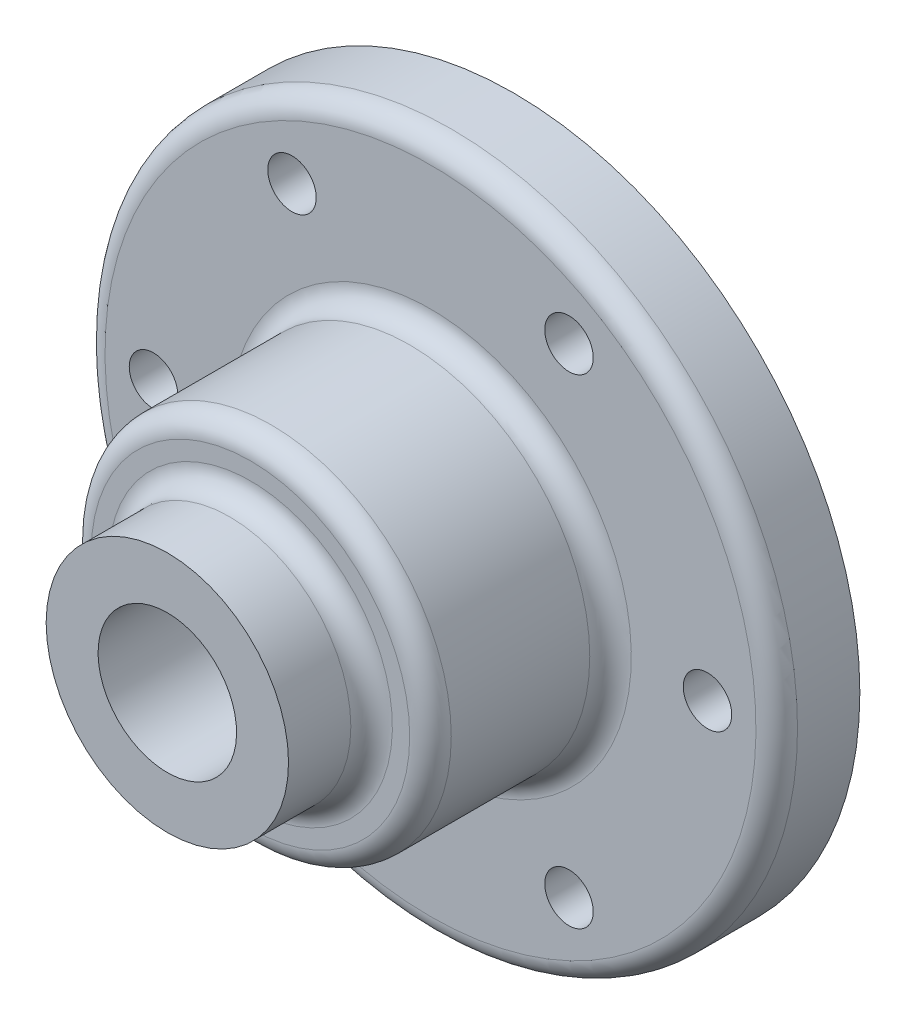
ISO-10303-21;
HEADER;
FILE_DESCRIPTION(('STEP AP214'),'2;1');
FILE_NAME('part.step','',(''),(''),'','','');
FILE_SCHEMA(('AUTOMOTIVE_DESIGN { 1 0 10303 214 1 1 1 1 }'));
ENDSEC;
DATA;
#1=APPLICATION_CONTEXT('core data for automotive mechanical design processes');
#2=APPLICATION_PROTOCOL_DEFINITION('international standard','automotive_design',2000,#1);
#3=PRODUCT_CONTEXT('',#1,'mechanical');
#4=PRODUCT('Part','Part','',(#3));
#5=PRODUCT_RELATED_PRODUCT_CATEGORY('part','',(#4));
#6=PRODUCT_DEFINITION_FORMATION('','',#4);
#7=PRODUCT_DEFINITION_CONTEXT('part definition',#1,'design');
#8=PRODUCT_DEFINITION('design','',#6,#7);
#9=PRODUCT_DEFINITION_SHAPE('','',#8);
#10=(LENGTH_UNIT() NAMED_UNIT(*) SI_UNIT(.MILLI.,.METRE.));
#11=(NAMED_UNIT(*) PLANE_ANGLE_UNIT() SI_UNIT($,.RADIAN.));
#12=(NAMED_UNIT(*) SI_UNIT($,.STERADIAN.) SOLID_ANGLE_UNIT());
#13=UNCERTAINTY_MEASURE_WITH_UNIT(LENGTH_MEASURE(1.E-05),#10,'distance_accuracy_value','');
#14=(GEOMETRIC_REPRESENTATION_CONTEXT(3) GLOBAL_UNCERTAINTY_ASSIGNED_CONTEXT((#13)) GLOBAL_UNIT_ASSIGNED_CONTEXT((#10,
#11,#12)) REPRESENTATION_CONTEXT('',''));
#15=CARTESIAN_POINT('',(0.,0.,0.));
#16=DIRECTION('',(0.,0.,1.));
#17=DIRECTION('',(1.,0.,0.));
#18=AXIS2_PLACEMENT_3D('',#15,#16,#17);
#19=CARTESIAN_POINT('',(0.,50.,0.));
#20=DIRECTION('',(0.,0.,-1.));
#21=DIRECTION('',(0.,1.,0.));
#22=AXIS2_PLACEMENT_3D('',#19,#20,#21);
#23=PLANE('',#22);
#24=CARTESIAN_POINT('',(0.,0.,0.));
#25=DIRECTION('',(0.,0.,-1.));
#26=DIRECTION('',(-1.,0.,0.));
#27=AXIS2_PLACEMENT_3D('',#24,#25,#26);
#28=CIRCLE('',#27,27.25);
#29=CARTESIAN_POINT('',(-27.25,0.,0.));
#30=VERTEX_POINT('',#29);
#31=EDGE_CURVE('E123',#30,#30,#28,.T.);
#32=ORIENTED_EDGE('',*,*,#31,.T.);
#33=EDGE_LOOP('',(#32));
#34=FACE_BOUND('',#33,.T.);
#35=CARTESIAN_POINT('',(0.,0.,0.));
#36=DIRECTION('',(0.,0.,-1.));
#37=DIRECTION('',(0.,1.,0.));
#38=AXIS2_PLACEMENT_3D('',#35,#36,#37);
#39=CIRCLE('',#38,20.);
#40=CARTESIAN_POINT('',(0.,20.,0.));
#41=VERTEX_POINT('',#40);
#42=EDGE_CURVE('E78',#41,#41,#39,.T.);
#43=ORIENTED_EDGE('',*,*,#42,.F.);
#44=EDGE_LOOP('',(#43));
#45=FACE_BOUND('',#44,.T.);
#46=ADVANCED_FACE('F34',(#34,#45),#23,.T.);
#47=CARTESIAN_POINT('',(0.,0.,0.));
#48=DIRECTION('',(0.,0.,-1.));
#49=DIRECTION('',(0.,1.,0.));
#50=AXIS2_PLACEMENT_3D('',#47,#48,#49);
#51=CYLINDRICAL_SURFACE('',#50,17.5);
#52=CARTESIAN_POINT('',(0.,0.,41.));
#53=DIRECTION('',(0.,0.,1.));
#54=DIRECTION('',(0.,-1.,0.));
#55=AXIS2_PLACEMENT_3D('',#52,#53,#54);
#56=CIRCLE('',#55,17.5);
#57=CARTESIAN_POINT('',(0.,-17.5,41.));
#58=VERTEX_POINT('',#57);
#59=EDGE_CURVE('E57',#58,#58,#56,.T.);
#60=ORIENTED_EDGE('',*,*,#59,.T.);
#61=EDGE_LOOP('',(#60));
#62=FACE_BOUND('',#61,.T.);
#63=CARTESIAN_POINT('',(0.,0.,50.));
#64=DIRECTION('',(0.,0.,-1.));
#65=DIRECTION('',(0.,1.,0.));
#66=AXIS2_PLACEMENT_3D('',#63,#64,#65);
#67=CIRCLE('',#66,17.5);
#68=CARTESIAN_POINT('',(0.,17.5,50.));
#69=VERTEX_POINT('',#68);
#70=EDGE_CURVE('E66',#69,#69,#67,.T.);
#71=ORIENTED_EDGE('',*,*,#70,.T.);
#72=EDGE_LOOP('',(#71));
#73=FACE_BOUND('',#72,.T.);
#74=ADVANCED_FACE('F154',(#62,#73),#51,.T.);
#75=CARTESIAN_POINT('',(0.,17.5,50.));
#76=DIRECTION('',(0.,0.,1.));
#77=DIRECTION('',(0.,-1.,0.));
#78=AXIS2_PLACEMENT_3D('',#75,#76,#77);
#79=PLANE('',#78);
#80=CARTESIAN_POINT('',(0.,0.,50.));
#81=DIRECTION('',(0.,0.,-1.));
#82=DIRECTION('',(0.,1.,0.));
#83=AXIS2_PLACEMENT_3D('',#80,#81,#82);
#84=CIRCLE('',#83,10.);
#85=CARTESIAN_POINT('',(0.,9.99999999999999,50.));
#86=VERTEX_POINT('',#85);
#87=EDGE_CURVE('E69',#86,#86,#84,.T.);
#88=ORIENTED_EDGE('',*,*,#87,.T.);
#89=EDGE_LOOP('',(#88));
#90=FACE_BOUND('',#89,.T.);
#91=ORIENTED_EDGE('',*,*,#70,.F.);
#92=EDGE_LOOP('',(#91));
#93=FACE_BOUND('',#92,.T.);
#94=ADVANCED_FACE('F161',(#90,#93),#79,.T.);
#95=CARTESIAN_POINT('',(0.,0.,0.));
#96=DIRECTION('',(0.,0.,-1.));
#97=DIRECTION('',(0.,1.,0.));
#98=AXIS2_PLACEMENT_3D('',#95,#96,#97);
#99=CYLINDRICAL_SURFACE('',#98,10.);
#100=CARTESIAN_POINT('',(0.,0.,9.99999999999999));
#101=DIRECTION('',(0.,0.,-1.));
#102=DIRECTION('',(0.,1.,0.));
#103=AXIS2_PLACEMENT_3D('',#100,#101,#102);
#104=CIRCLE('',#103,10.);
#105=CARTESIAN_POINT('',(0.,10.,9.99999999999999));
#106=VERTEX_POINT('',#105);
#107=EDGE_CURVE('E72',#106,#106,#104,.T.);
#108=ORIENTED_EDGE('',*,*,#107,.T.);
#109=EDGE_LOOP('',(#108));
#110=FACE_BOUND('',#109,.T.);
#111=ORIENTED_EDGE('',*,*,#87,.F.);
#112=EDGE_LOOP('',(#111));
#113=FACE_BOUND('',#112,.T.);
#114=ADVANCED_FACE('F401',(#110,#113),#99,.F.);
#115=CARTESIAN_POINT('',(0.,20.,9.99999999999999));
#116=DIRECTION('',(0.,0.,-1.));
#117=DIRECTION('',(0.,1.,0.));
#118=AXIS2_PLACEMENT_3D('',#115,#116,#117);
#119=PLANE('',#118);
#120=CARTESIAN_POINT('',(0.,0.,9.99999999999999));
#121=DIRECTION('',(0.,0.,-1.));
#122=DIRECTION('',(0.,1.,0.));
#123=AXIS2_PLACEMENT_3D('',#120,#121,#122);
#124=CIRCLE('',#123,20.);
#125=CARTESIAN_POINT('',(0.,20.,10.));
#126=VERTEX_POINT('',#125);
#127=EDGE_CURVE('E75',#126,#126,#124,.T.);
#128=ORIENTED_EDGE('',*,*,#127,.T.);
#129=EDGE_LOOP('',(#128));
#130=FACE_BOUND('',#129,.T.);
#131=ORIENTED_EDGE('',*,*,#107,.F.);
#132=EDGE_LOOP('',(#131));
#133=FACE_BOUND('',#132,.T.);
#134=ADVANCED_FACE('F176',(#130,#133),#119,.T.);
#135=CARTESIAN_POINT('',(0.,0.,0.));
#136=DIRECTION('',(0.,0.,-1.));
#137=DIRECTION('',(0.,1.,0.));
#138=AXIS2_PLACEMENT_3D('',#135,#136,#137);
#139=CYLINDRICAL_SURFACE('',#138,20.);
#140=ORIENTED_EDGE('',*,*,#42,.T.);
#141=EDGE_LOOP('',(#140));
#142=FACE_BOUND('',#141,.T.);
#143=ORIENTED_EDGE('',*,*,#127,.F.);
#144=EDGE_LOOP('',(#143));
#145=FACE_BOUND('',#144,.T.);
#146=ADVANCED_FACE('F169',(#142,#145),#139,.F.);
#147=CARTESIAN_POINT('',(0.,0.,0.));
#148=DIRECTION('',(0.,0.,-1.));
#149=DIRECTION('',(-1.,0.,0.));
#150=AXIS2_PLACEMENT_3D('',#147,#148,#149);
#151=CIRCLE('',#150,30.8);
#152=CARTESIAN_POINT('',(-30.8,0.,0.));
#153=VERTEX_POINT('',#152);
#154=EDGE_CURVE('E126',#153,#153,#151,.T.);
#155=ORIENTED_EDGE('',*,*,#154,.F.);
#156=EDGE_LOOP('',(#155));
#157=FACE_BOUND('',#156,.T.);
#158=CARTESIAN_POINT('',(20.0000000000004,34.6410161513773,0.));
#159=DIRECTION('',(0.,0.,1.));
#160=DIRECTION('',(0.50000000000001,0.866025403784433,0.));
#161=AXIS2_PLACEMENT_3D('',#158,#159,#160);
#162=CIRCLE('',#161,3.5);
#163=CARTESIAN_POINT('',(21.7500000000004,37.6721050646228,0.));
#164=VERTEX_POINT('',#163);
#165=EDGE_CURVE('E101',#164,#164,#162,.T.);
#166=ORIENTED_EDGE('',*,*,#165,.T.);
#167=EDGE_LOOP('',(#166));
#168=FACE_BOUND('',#167,.T.);
#169=CARTESIAN_POINT('',(-19.9999999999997,34.6410161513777,0.));
#170=DIRECTION('',(0.,0.,1.));
#171=DIRECTION('',(-0.499999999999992,0.866025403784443,0.));
#172=AXIS2_PLACEMENT_3D('',#169,#170,#171);
#173=CIRCLE('',#172,3.5);
#174=CARTESIAN_POINT('',(-21.7499999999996,37.6721050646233,0.));
#175=VERTEX_POINT('',#174);
#176=EDGE_CURVE('E100',#175,#175,#173,.T.);
#177=ORIENTED_EDGE('',*,*,#176,.T.);
#178=EDGE_LOOP('',(#177));
#179=FACE_BOUND('',#178,.T.);
#180=CARTESIAN_POINT('',(-40.,0.,0.));
#181=DIRECTION('',(0.,0.,1.));
#182=DIRECTION('',(-1.,0.,0.));
#183=AXIS2_PLACEMENT_3D('',#180,#181,#182);
#184=CIRCLE('',#183,3.5);
#185=CARTESIAN_POINT('',(-43.5,0.,0.));
#186=VERTEX_POINT('',#185);
#187=EDGE_CURVE('E108',#186,#186,#184,.T.);
#188=ORIENTED_EDGE('',*,*,#187,.T.);
#189=EDGE_LOOP('',(#188));
#190=FACE_BOUND('',#189,.T.);
#191=CARTESIAN_POINT('',(-20.0000000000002,-34.6410161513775,0.));
#192=DIRECTION('',(0.,0.,1.));
#193=DIRECTION('',(-0.500000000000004,-0.866025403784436,0.));
#194=AXIS2_PLACEMENT_3D('',#191,#192,#193);
#195=CIRCLE('',#194,3.5);
#196=CARTESIAN_POINT('',(-21.7500000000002,-37.672105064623,0.));
#197=VERTEX_POINT('',#196);
#198=EDGE_CURVE('E114',#197,#197,#195,.T.);
#199=ORIENTED_EDGE('',*,*,#198,.T.);
#200=EDGE_LOOP('',(#199));
#201=FACE_BOUND('',#200,.T.);
#202=CARTESIAN_POINT('',(19.9999999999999,-34.6410161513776,0.));
#203=DIRECTION('',(0.,0.,1.));
#204=DIRECTION('',(0.499999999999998,-0.86602540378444,0.));
#205=AXIS2_PLACEMENT_3D('',#202,#203,#204);
#206=CIRCLE('',#205,3.5);
#207=CARTESIAN_POINT('',(21.7499999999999,-37.6721050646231,0.));
#208=VERTEX_POINT('',#207);
#209=EDGE_CURVE('E93',#208,#208,#206,.T.);
#210=ORIENTED_EDGE('',*,*,#209,.T.);
#211=EDGE_LOOP('',(#210));
#212=FACE_BOUND('',#211,.T.);
#213=CARTESIAN_POINT('',(40.,0.,0.));
#214=DIRECTION('',(0.,0.,1.));
#215=DIRECTION('',(1.,0.,0.));
#216=AXIS2_PLACEMENT_3D('',#213,#214,#215);
#217=CIRCLE('',#216,3.5);
#218=CARTESIAN_POINT('',(43.5,0.,0.));
#219=VERTEX_POINT('',#218);
#220=EDGE_CURVE('E84',#219,#219,#217,.T.);
#221=ORIENTED_EDGE('',*,*,#220,.T.);
#222=EDGE_LOOP('',(#221));
#223=FACE_BOUND('',#222,.T.);
#224=CARTESIAN_POINT('',(0.,0.,0.));
#225=DIRECTION('',(0.,0.,-1.));
#226=DIRECTION('',(0.,1.,0.));
#227=AXIS2_PLACEMENT_3D('',#224,#225,#226);
#228=CIRCLE('',#227,50.);
#229=CARTESIAN_POINT('',(0.,50.,0.));
#230=VERTEX_POINT('',#229);
#231=EDGE_CURVE('E81',#230,#230,#228,.T.);
#232=ORIENTED_EDGE('',*,*,#231,.T.);
#233=EDGE_LOOP('',(#232));
#234=FACE_BOUND('',#233,.T.);
#235=ADVANCED_FACE('F157',(#157,#168,#179,#190,#201,#212,#223,#234),#23,.T.);
#236=CARTESIAN_POINT('',(0.,0.,0.));
#237=DIRECTION('',(0.,0.,-1.));
#238=DIRECTION('',(0.,1.,0.));
#239=AXIS2_PLACEMENT_3D('',#236,#237,#238);
#240=CYLINDRICAL_SURFACE('',#239,50.);
#241=CARTESIAN_POINT('',(0.,0.,8.99999999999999));
#242=DIRECTION('',(0.,0.,1.));
#243=DIRECTION('',(0.,-1.,0.));
#244=AXIS2_PLACEMENT_3D('',#241,#242,#243);
#245=CIRCLE('',#244,50.);
#246=CARTESIAN_POINT('',(0.,-50.,8.99999999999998));
#247=VERTEX_POINT('',#246);
#248=EDGE_CURVE('E10',#247,#247,#245,.F.);
#249=ORIENTED_EDGE('',*,*,#248,.T.);
#250=EDGE_LOOP('',(#249));
#251=FACE_BOUND('',#250,.T.);
#252=ORIENTED_EDGE('',*,*,#231,.F.);
#253=EDGE_LOOP('',(#252));
#254=FACE_BOUND('',#253,.T.);
#255=ADVANCED_FACE('F168',(#251,#254),#240,.T.);
#256=CARTESIAN_POINT('',(0.,26.,12.));
#257=DIRECTION('',(0.,0.,1.));
#258=DIRECTION('',(0.,-1.,0.));
#259=AXIS2_PLACEMENT_3D('',#256,#257,#258);
#260=PLANE('',#259);
#261=CARTESIAN_POINT('',(0.,0.,12.));
#262=DIRECTION('',(0.,0.,1.));
#263=DIRECTION('',(0.,-1.,0.));
#264=AXIS2_PLACEMENT_3D('',#261,#262,#263);
#265=CIRCLE('',#264,29.);
#266=CARTESIAN_POINT('',(0.,-29.,12.));
#267=VERTEX_POINT('',#266);
#268=EDGE_CURVE('E41',#267,#267,#265,.F.);
#269=ORIENTED_EDGE('',*,*,#268,.T.);
#270=EDGE_LOOP('',(#269));
#271=FACE_BOUND('',#270,.T.);
#272=CARTESIAN_POINT('',(0.,0.,12.));
#273=DIRECTION('',(0.,0.,1.));
#274=DIRECTION('',(0.,-1.,0.));
#275=AXIS2_PLACEMENT_3D('',#272,#273,#274);
#276=CIRCLE('',#275,47.);
#277=CARTESIAN_POINT('',(0.,-47.,12.));
#278=VERTEX_POINT('',#277);
#279=EDGE_CURVE('E45',#278,#278,#276,.T.);
#280=ORIENTED_EDGE('',*,*,#279,.T.);
#281=EDGE_LOOP('',(#280));
#282=FACE_BOUND('',#281,.T.);
#283=CARTESIAN_POINT('',(20.0000000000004,34.6410161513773,12.));
#284=DIRECTION('',(0.,0.,1.));
#285=DIRECTION('',(0.50000000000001,0.866025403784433,0.));
#286=AXIS2_PLACEMENT_3D('',#283,#284,#285);
#287=CIRCLE('',#286,3.5);
#288=CARTESIAN_POINT('',(21.7500000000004,37.6721050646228,12.));
#289=VERTEX_POINT('',#288);
#290=EDGE_CURVE('E97',#289,#289,#287,.T.);
#291=ORIENTED_EDGE('',*,*,#290,.F.);
#292=EDGE_LOOP('',(#291));
#293=FACE_BOUND('',#292,.T.);
#294=CARTESIAN_POINT('',(-19.9999999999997,34.6410161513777,12.));
#295=DIRECTION('',(0.,0.,1.));
#296=DIRECTION('',(-0.499999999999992,0.866025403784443,0.));
#297=AXIS2_PLACEMENT_3D('',#294,#295,#296);
#298=CIRCLE('',#297,3.5);
#299=CARTESIAN_POINT('',(-21.7499999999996,37.6721050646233,12.));
#300=VERTEX_POINT('',#299);
#301=EDGE_CURVE('E105',#300,#300,#298,.T.);
#302=ORIENTED_EDGE('',*,*,#301,.F.);
#303=EDGE_LOOP('',(#302));
#304=FACE_BOUND('',#303,.T.);
#305=CARTESIAN_POINT('',(-40.,0.,12.));
#306=DIRECTION('',(0.,0.,1.));
#307=DIRECTION('',(-1.,0.,0.));
#308=AXIS2_PLACEMENT_3D('',#305,#306,#307);
#309=CIRCLE('',#308,3.5);
#310=CARTESIAN_POINT('',(-43.5,0.,12.));
#311=VERTEX_POINT('',#310);
#312=EDGE_CURVE('E111',#311,#311,#309,.T.);
#313=ORIENTED_EDGE('',*,*,#312,.F.);
#314=EDGE_LOOP('',(#313));
#315=FACE_BOUND('',#314,.T.);
#316=CARTESIAN_POINT('',(-20.0000000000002,-34.6410161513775,12.));
#317=DIRECTION('',(0.,0.,1.));
#318=DIRECTION('',(-0.500000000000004,-0.866025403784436,0.));
#319=AXIS2_PLACEMENT_3D('',#316,#317,#318);
#320=CIRCLE('',#319,3.5);
#321=CARTESIAN_POINT('',(-21.7500000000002,-37.672105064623,12.));
#322=VERTEX_POINT('',#321);
#323=EDGE_CURVE('E96',#322,#322,#320,.T.);
#324=ORIENTED_EDGE('',*,*,#323,.F.);
#325=EDGE_LOOP('',(#324));
#326=FACE_BOUND('',#325,.T.);
#327=CARTESIAN_POINT('',(19.9999999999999,-34.6410161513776,12.));
#328=DIRECTION('',(0.,0.,1.));
#329=DIRECTION('',(0.499999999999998,-0.86602540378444,0.));
#330=AXIS2_PLACEMENT_3D('',#327,#328,#329);
#331=CIRCLE('',#330,3.5);
#332=CARTESIAN_POINT('',(21.7499999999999,-37.6721050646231,12.));
#333=VERTEX_POINT('',#332);
#334=EDGE_CURVE('E90',#333,#333,#331,.T.);
#335=ORIENTED_EDGE('',*,*,#334,.F.);
#336=EDGE_LOOP('',(#335));
#337=FACE_BOUND('',#336,.T.);
#338=CARTESIAN_POINT('',(40.,0.,12.));
#339=DIRECTION('',(0.,0.,1.));
#340=DIRECTION('',(1.,0.,0.));
#341=AXIS2_PLACEMENT_3D('',#338,#339,#340);
#342=CIRCLE('',#341,3.5);
#343=CARTESIAN_POINT('',(43.5,0.,12.));
#344=VERTEX_POINT('',#343);
#345=EDGE_CURVE('E87',#344,#344,#342,.T.);
#346=ORIENTED_EDGE('',*,*,#345,.F.);
#347=EDGE_LOOP('',(#346));
#348=FACE_BOUND('',#347,.T.);
#349=ADVANCED_FACE('F175',(#271,#282,#293,#304,#315,#326,#337,#348),#260,.T.);
#350=CARTESIAN_POINT('',(0.,0.,0.));
#351=DIRECTION('',(0.,0.,-1.));
#352=DIRECTION('',(0.,1.,0.));
#353=AXIS2_PLACEMENT_3D('',#350,#351,#352);
#354=CYLINDRICAL_SURFACE('',#353,26.);
#355=CARTESIAN_POINT('',(0.,0.,35.));
#356=DIRECTION('',(0.,0.,1.));
#357=DIRECTION('',(0.,-1.,0.));
#358=AXIS2_PLACEMENT_3D('',#355,#356,#357);
#359=CIRCLE('',#358,26.);
#360=CARTESIAN_POINT('',(0.,-26.,35.));
#361=VERTEX_POINT('',#360);
#362=EDGE_CURVE('E49',#361,#361,#359,.F.);
#363=ORIENTED_EDGE('',*,*,#362,.T.);
#364=EDGE_LOOP('',(#363));
#365=FACE_BOUND('',#364,.T.);
#366=CARTESIAN_POINT('',(0.,0.,15.));
#367=DIRECTION('',(0.,0.,1.));
#368=DIRECTION('',(0.,-1.,0.));
#369=AXIS2_PLACEMENT_3D('',#366,#367,#368);
#370=CIRCLE('',#369,26.);
#371=CARTESIAN_POINT('',(0.,-26.,15.));
#372=VERTEX_POINT('',#371);
#373=EDGE_CURVE('E54',#372,#372,#370,.T.);
#374=ORIENTED_EDGE('',*,*,#373,.T.);
#375=EDGE_LOOP('',(#374));
#376=FACE_BOUND('',#375,.T.);
#377=ADVANCED_FACE('F204',(#365,#376),#354,.T.);
#378=CARTESIAN_POINT('',(0.,17.5,38.));
#379=DIRECTION('',(0.,0.,1.));
#380=DIRECTION('',(0.,-1.,0.));
#381=AXIS2_PLACEMENT_3D('',#378,#379,#380);
#382=PLANE('',#381);
#383=CARTESIAN_POINT('',(0.,0.,38.));
#384=DIRECTION('',(0.,0.,1.));
#385=DIRECTION('',(0.,-1.,0.));
#386=AXIS2_PLACEMENT_3D('',#383,#384,#385);
#387=CIRCLE('',#386,20.5);
#388=CARTESIAN_POINT('',(0.,-20.5,38.));
#389=VERTEX_POINT('',#388);
#390=EDGE_CURVE('E60',#389,#389,#387,.F.);
#391=ORIENTED_EDGE('',*,*,#390,.T.);
#392=EDGE_LOOP('',(#391));
#393=FACE_BOUND('',#392,.T.);
#394=CARTESIAN_POINT('',(0.,0.,38.));
#395=DIRECTION('',(0.,0.,1.));
#396=DIRECTION('',(0.,-1.,0.));
#397=AXIS2_PLACEMENT_3D('',#394,#395,#396);
#398=CIRCLE('',#397,23.);
#399=CARTESIAN_POINT('',(0.,-23.,38.));
#400=VERTEX_POINT('',#399);
#401=EDGE_CURVE('E63',#400,#400,#398,.T.);
#402=ORIENTED_EDGE('',*,*,#401,.T.);
#403=EDGE_LOOP('',(#402));
#404=FACE_BOUND('',#403,.T.);
#405=ADVANCED_FACE('F199',(#393,#404),#382,.T.);
#406=CARTESIAN_POINT('',(40.,0.,12.));
#407=DIRECTION('',(0.,0.,1.));
#408=DIRECTION('',(1.,0.,0.));
#409=AXIS2_PLACEMENT_3D('',#406,#407,#408);
#410=CYLINDRICAL_SURFACE('',#409,3.5);
#411=ORIENTED_EDGE('',*,*,#220,.F.);
#412=EDGE_LOOP('',(#411));
#413=FACE_BOUND('',#412,.T.);
#414=ORIENTED_EDGE('',*,*,#345,.T.);
#415=EDGE_LOOP('',(#414));
#416=FACE_BOUND('',#415,.T.);
#417=ADVANCED_FACE('F195',(#413,#416),#410,.F.);
#418=CARTESIAN_POINT('',(19.9999999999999,-34.6410161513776,12.));
#419=DIRECTION('',(0.,0.,1.));
#420=DIRECTION('',(0.499999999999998,-0.86602540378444,0.));
#421=AXIS2_PLACEMENT_3D('',#418,#419,#420);
#422=CYLINDRICAL_SURFACE('',#421,3.5);
#423=ORIENTED_EDGE('',*,*,#209,.F.);
#424=EDGE_LOOP('',(#423));
#425=FACE_BOUND('',#424,.T.);
#426=ORIENTED_EDGE('',*,*,#334,.T.);
#427=EDGE_LOOP('',(#426));
#428=FACE_BOUND('',#427,.T.);
#429=ADVANCED_FACE('F198',(#425,#428),#422,.F.);
#430=CARTESIAN_POINT('',(-20.0000000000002,-34.6410161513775,12.));
#431=DIRECTION('',(0.,0.,1.));
#432=DIRECTION('',(-0.500000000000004,-0.866025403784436,0.));
#433=AXIS2_PLACEMENT_3D('',#430,#431,#432);
#434=CYLINDRICAL_SURFACE('',#433,3.5);
#435=ORIENTED_EDGE('',*,*,#198,.F.);
#436=EDGE_LOOP('',(#435));
#437=FACE_BOUND('',#436,.T.);
#438=ORIENTED_EDGE('',*,*,#323,.T.);
#439=EDGE_LOOP('',(#438));
#440=FACE_BOUND('',#439,.T.);
#441=ADVANCED_FACE('F218',(#437,#440),#434,.F.);
#442=CARTESIAN_POINT('',(-40.,0.,12.));
#443=DIRECTION('',(0.,0.,1.));
#444=DIRECTION('',(-1.,0.,0.));
#445=AXIS2_PLACEMENT_3D('',#442,#443,#444);
#446=CYLINDRICAL_SURFACE('',#445,3.5);
#447=ORIENTED_EDGE('',*,*,#187,.F.);
#448=EDGE_LOOP('',(#447));
#449=FACE_BOUND('',#448,.T.);
#450=ORIENTED_EDGE('',*,*,#312,.T.);
#451=EDGE_LOOP('',(#450));
#452=FACE_BOUND('',#451,.T.);
#453=ADVANCED_FACE('F228',(#449,#452),#446,.F.);
#454=CARTESIAN_POINT('',(-19.9999999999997,34.6410161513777,12.));
#455=DIRECTION('',(0.,0.,1.));
#456=DIRECTION('',(-0.499999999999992,0.866025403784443,0.));
#457=AXIS2_PLACEMENT_3D('',#454,#455,#456);
#458=CYLINDRICAL_SURFACE('',#457,3.5);
#459=ORIENTED_EDGE('',*,*,#176,.F.);
#460=EDGE_LOOP('',(#459));
#461=FACE_BOUND('',#460,.T.);
#462=ORIENTED_EDGE('',*,*,#301,.T.);
#463=EDGE_LOOP('',(#462));
#464=FACE_BOUND('',#463,.T.);
#465=ADVANCED_FACE('F224',(#461,#464),#458,.F.);
#466=CARTESIAN_POINT('',(20.0000000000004,34.6410161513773,12.));
#467=DIRECTION('',(0.,0.,1.));
#468=DIRECTION('',(0.50000000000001,0.866025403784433,0.));
#469=AXIS2_PLACEMENT_3D('',#466,#467,#468);
#470=CYLINDRICAL_SURFACE('',#469,3.5);
#471=ORIENTED_EDGE('',*,*,#165,.F.);
#472=EDGE_LOOP('',(#471));
#473=FACE_BOUND('',#472,.T.);
#474=ORIENTED_EDGE('',*,*,#290,.T.);
#475=EDGE_LOOP('',(#474));
#476=FACE_BOUND('',#475,.T.);
#477=ADVANCED_FACE('F220',(#473,#476),#470,.F.);
#478=CARTESIAN_POINT('',(0.,0.,41.));
#479=DIRECTION('',(0.,0.,1.));
#480=DIRECTION('',(0.,-1.,0.));
#481=AXIS2_PLACEMENT_3D('',#478,#479,#480);
#482=TOROIDAL_SURFACE('',#481,20.5,3.);
#483=ORIENTED_EDGE('',*,*,#59,.F.);
#484=EDGE_LOOP('',(#483));
#485=FACE_BOUND('',#484,.T.);
#486=ORIENTED_EDGE('',*,*,#390,.F.);
#487=EDGE_LOOP('',(#486));
#488=FACE_BOUND('',#487,.T.);
#489=ADVANCED_FACE('F223',(#485,#488),#482,.F.);
#490=CARTESIAN_POINT('',(0.,0.,35.));
#491=DIRECTION('',(0.,0.,1.));
#492=DIRECTION('',(0.,-1.,0.));
#493=AXIS2_PLACEMENT_3D('',#490,#491,#492);
#494=TOROIDAL_SURFACE('',#493,23.,3.);
#495=ORIENTED_EDGE('',*,*,#401,.F.);
#496=EDGE_LOOP('',(#495));
#497=FACE_BOUND('',#496,.T.);
#498=ORIENTED_EDGE('',*,*,#362,.F.);
#499=EDGE_LOOP('',(#498));
#500=FACE_BOUND('',#499,.T.);
#501=ADVANCED_FACE('F304',(#497,#500),#494,.T.);
#502=CARTESIAN_POINT('',(0.,0.,15.));
#503=DIRECTION('',(0.,0.,1.));
#504=DIRECTION('',(0.,-1.,0.));
#505=AXIS2_PLACEMENT_3D('',#502,#503,#504);
#506=TOROIDAL_SURFACE('',#505,29.,3.);
#507=ORIENTED_EDGE('',*,*,#373,.F.);
#508=EDGE_LOOP('',(#507));
#509=FACE_BOUND('',#508,.T.);
#510=ORIENTED_EDGE('',*,*,#268,.F.);
#511=EDGE_LOOP('',(#510));
#512=FACE_BOUND('',#511,.T.);
#513=ADVANCED_FACE('F295',(#509,#512),#506,.F.);
#514=CARTESIAN_POINT('',(0.,0.,8.99999999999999));
#515=DIRECTION('',(0.,0.,1.));
#516=DIRECTION('',(0.,-1.,0.));
#517=AXIS2_PLACEMENT_3D('',#514,#515,#516);
#518=TOROIDAL_SURFACE('',#517,47.,3.);
#519=ORIENTED_EDGE('',*,*,#279,.F.);
#520=EDGE_LOOP('',(#519));
#521=FACE_BOUND('',#520,.T.);
#522=ORIENTED_EDGE('',*,*,#248,.F.);
#523=EDGE_LOOP('',(#522));
#524=FACE_BOUND('',#523,.T.);
#525=ADVANCED_FACE('F36',(#521,#524),#518,.T.);
#526=CARTESIAN_POINT('',(0.,0.,2.075));
#527=DIRECTION('',(0.,0.,-1.));
#528=DIRECTION('',(-1.,0.,0.));
#529=AXIS2_PLACEMENT_3D('',#526,#527,#528);
#530=TOROIDAL_SURFACE('',#529,27.85,0.6);
#531=CARTESIAN_POINT('',(0.,0.,2.675));
#532=DIRECTION('',(0.,0.,-1.));
#533=DIRECTION('',(-1.,0.,0.));
#534=AXIS2_PLACEMENT_3D('',#531,#532,#533);
#535=CIRCLE('',#534,27.85);
#536=CARTESIAN_POINT('',(-27.85,0.,2.675));
#537=VERTEX_POINT('',#536);
#538=EDGE_CURVE('E135',#537,#537,#535,.T.);
#539=ORIENTED_EDGE('',*,*,#538,.T.);
#540=EDGE_LOOP('',(#539));
#541=FACE_BOUND('',#540,.T.);
#542=CARTESIAN_POINT('',(0.,0.,2.075));
#543=DIRECTION('',(0.,0.,-1.));
#544=DIRECTION('',(-1.,0.,0.));
#545=AXIS2_PLACEMENT_3D('',#542,#543,#544);
#546=CIRCLE('',#545,27.25);
#547=CARTESIAN_POINT('',(-27.25,0.,2.075));
#548=VERTEX_POINT('',#547);
#549=EDGE_CURVE('E104',#548,#548,#546,.T.);
#550=ORIENTED_EDGE('',*,*,#549,.F.);
#551=EDGE_LOOP('',(#550));
#552=FACE_BOUND('',#551,.T.);
#553=ADVANCED_FACE('F139',(#541,#552),#530,.F.);
#554=CARTESIAN_POINT('',(0.,0.,-50.));
#555=DIRECTION('',(0.,0.,-1.));
#556=DIRECTION('',(-1.,0.,0.));
#557=AXIS2_PLACEMENT_3D('',#554,#555,#556);
#558=CYLINDRICAL_SURFACE('',#557,27.25);
#559=ORIENTED_EDGE('',*,*,#549,.T.);
#560=EDGE_LOOP('',(#559));
#561=FACE_BOUND('',#560,.T.);
#562=ORIENTED_EDGE('',*,*,#31,.F.);
#563=EDGE_LOOP('',(#562));
#564=FACE_BOUND('',#563,.T.);
#565=ADVANCED_FACE('F238',(#561,#564),#558,.T.);
#566=CARTESIAN_POINT('',(0.,0.,-50.));
#567=DIRECTION('',(0.,0.,-1.));
#568=DIRECTION('',(-1.,0.,0.));
#569=AXIS2_PLACEMENT_3D('',#566,#567,#568);
#570=CYLINDRICAL_SURFACE('',#569,30.8);
#571=ORIENTED_EDGE('',*,*,#154,.T.);
#572=EDGE_LOOP('',(#571));
#573=FACE_BOUND('',#572,.T.);
#574=CARTESIAN_POINT('',(0.,0.,2.075));
#575=DIRECTION('',(0.,0.,-1.));
#576=DIRECTION('',(-1.,0.,0.));
#577=AXIS2_PLACEMENT_3D('',#574,#575,#576);
#578=CIRCLE('',#577,30.8);
#579=CARTESIAN_POINT('',(-30.8,0.,2.075));
#580=VERTEX_POINT('',#579);
#581=EDGE_CURVE('E129',#580,#580,#578,.T.);
#582=ORIENTED_EDGE('',*,*,#581,.F.);
#583=EDGE_LOOP('',(#582));
#584=FACE_BOUND('',#583,.T.);
#585=ADVANCED_FACE('F150',(#573,#584),#570,.F.);
#586=CARTESIAN_POINT('',(0.,0.,2.075));
#587=DIRECTION('',(0.,0.,-1.));
#588=DIRECTION('',(-1.,0.,0.));
#589=AXIS2_PLACEMENT_3D('',#586,#587,#588);
#590=TOROIDAL_SURFACE('',#589,30.2,0.6);
#591=ORIENTED_EDGE('',*,*,#581,.T.);
#592=EDGE_LOOP('',(#591));
#593=FACE_BOUND('',#592,.T.);
#594=CARTESIAN_POINT('',(0.,0.,2.675));
#595=DIRECTION('',(0.,0.,-1.));
#596=DIRECTION('',(-1.,0.,0.));
#597=AXIS2_PLACEMENT_3D('',#594,#595,#596);
#598=CIRCLE('',#597,30.2);
#599=CARTESIAN_POINT('',(-30.2,0.,2.675));
#600=VERTEX_POINT('',#599);
#601=EDGE_CURVE('E132',#600,#600,#598,.T.);
#602=ORIENTED_EDGE('',*,*,#601,.F.);
#603=EDGE_LOOP('',(#602));
#604=FACE_BOUND('',#603,.T.);
#605=ADVANCED_FACE('F144',(#593,#604),#590,.F.);
#606=CARTESIAN_POINT('',(30.2,0.,2.675));
#607=DIRECTION('',(0.,0.,-1.));
#608=DIRECTION('',(-1.,0.,0.));
#609=AXIS2_PLACEMENT_3D('',#606,#607,#608);
#610=PLANE('',#609);
#611=ORIENTED_EDGE('',*,*,#601,.T.);
#612=EDGE_LOOP('',(#611));
#613=FACE_BOUND('',#612,.T.);
#614=ORIENTED_EDGE('',*,*,#538,.F.);
#615=EDGE_LOOP('',(#614));
#616=FACE_BOUND('',#615,.T.);
#617=ADVANCED_FACE('F142',(#613,#616),#610,.T.);
#618=CLOSED_SHELL('',(#46,#74,#94,#114,#134,#146,#235,#255,#349,#377,#405,#417,#429,#441,#453,
#465,#477,#489,#501,#513,#525,#553,#565,#585,#605,#617));
#619=MANIFOLD_SOLID_BREP('B2',#618);
#620=ADVANCED_BREP_SHAPE_REPRESENTATION('',(#18,#619),#14);
#621=SHAPE_DEFINITION_REPRESENTATION(#9,#620);
ENDSEC;
END-ISO-10303-21;
